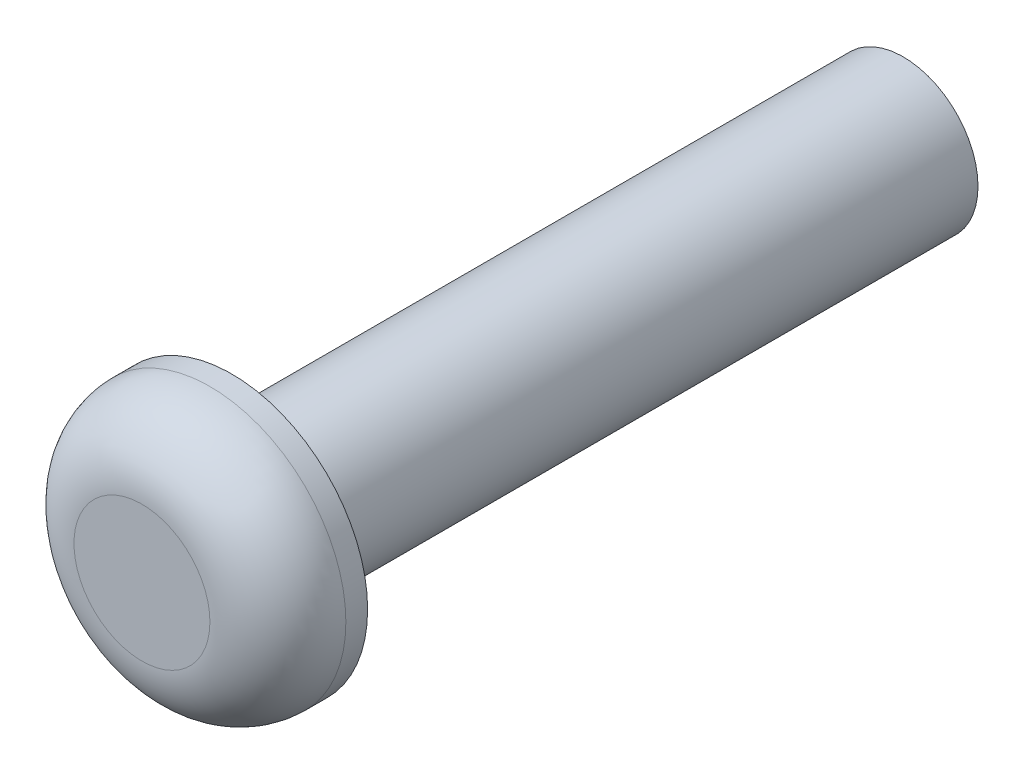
ISO-10303-21;
HEADER;
FILE_DESCRIPTION(('STEP AP214'),'2;1');
FILE_NAME('part.step','',(''),(''),'','','');
FILE_SCHEMA(('AUTOMOTIVE_DESIGN { 1 0 10303 214 1 1 1 1 }'));
ENDSEC;
DATA;
#1=APPLICATION_CONTEXT('core data for automotive mechanical design processes');
#2=APPLICATION_PROTOCOL_DEFINITION('international standard','automotive_design',2000,#1);
#3=PRODUCT_CONTEXT('',#1,'mechanical');
#4=PRODUCT('Part','Part','',(#3));
#5=PRODUCT_RELATED_PRODUCT_CATEGORY('part','',(#4));
#6=PRODUCT_DEFINITION_FORMATION('','',#4);
#7=PRODUCT_DEFINITION_CONTEXT('part definition',#1,'design');
#8=PRODUCT_DEFINITION('design','',#6,#7);
#9=PRODUCT_DEFINITION_SHAPE('','',#8);
#10=(LENGTH_UNIT() NAMED_UNIT(*) SI_UNIT(.MILLI.,.METRE.));
#11=(NAMED_UNIT(*) PLANE_ANGLE_UNIT() SI_UNIT($,.RADIAN.));
#12=(NAMED_UNIT(*) SI_UNIT($,.STERADIAN.) SOLID_ANGLE_UNIT());
#13=UNCERTAINTY_MEASURE_WITH_UNIT(LENGTH_MEASURE(1.E-05),#10,'distance_accuracy_value','');
#14=(GEOMETRIC_REPRESENTATION_CONTEXT(3) GLOBAL_UNCERTAINTY_ASSIGNED_CONTEXT((#13)) GLOBAL_UNIT_ASSIGNED_CONTEXT((#10,
#11,#12)) REPRESENTATION_CONTEXT('',''));
#15=CARTESIAN_POINT('',(0.,0.,0.));
#16=DIRECTION('',(0.,0.,1.));
#17=DIRECTION('',(1.,0.,0.));
#18=AXIS2_PLACEMENT_3D('',#15,#16,#17);
#19=CARTESIAN_POINT('',(0.,0.,1.6764));
#20=DIRECTION('',(0.,0.,-1.));
#21=DIRECTION('',(-1.,0.,0.));
#22=AXIS2_PLACEMENT_3D('',#19,#20,#21);
#23=CYLINDRICAL_SURFACE('',#22,2.54);
#24=CARTESIAN_POINT('',(0.,0.,0.4064));
#25=DIRECTION('',(0.,0.,1.));
#26=DIRECTION('',(1.,0.,0.));
#27=AXIS2_PLACEMENT_3D('',#24,#25,#26);
#28=CIRCLE('',#27,2.54);
#29=CARTESIAN_POINT('',(2.54,0.,0.4064));
#30=VERTEX_POINT('',#29);
#31=EDGE_CURVE('E10',#30,#30,#28,.F.);
#32=ORIENTED_EDGE('',*,*,#31,.T.);
#33=EDGE_LOOP('',(#32));
#34=FACE_BOUND('',#33,.T.);
#35=CARTESIAN_POINT('',(0.,0.,0.));
#36=DIRECTION('',(0.,0.,1.));
#37=DIRECTION('',(1.,0.,0.));
#38=AXIS2_PLACEMENT_3D('',#35,#36,#37);
#39=CIRCLE('',#38,2.54);
#40=CARTESIAN_POINT('',(2.54,0.,0.));
#41=VERTEX_POINT('',#40);
#42=EDGE_CURVE('E41',#41,#41,#39,.T.);
#43=ORIENTED_EDGE('',*,*,#42,.T.);
#44=EDGE_LOOP('',(#43));
#45=FACE_BOUND('',#44,.T.);
#46=ADVANCED_FACE('F30',(#34,#45),#23,.T.);
#47=CARTESIAN_POINT('',(0.,0.,1.6764));
#48=DIRECTION('',(0.,0.,1.));
#49=DIRECTION('',(1.,0.,0.));
#50=AXIS2_PLACEMENT_3D('',#47,#48,#49);
#51=PLANE('',#50);
#52=CARTESIAN_POINT('',(0.,0.,1.6764));
#53=DIRECTION('',(0.,0.,1.));
#54=DIRECTION('',(1.,0.,0.));
#55=AXIS2_PLACEMENT_3D('',#52,#53,#54);
#56=CIRCLE('',#55,1.27);
#57=CARTESIAN_POINT('',(1.27,0.,1.6764));
#58=VERTEX_POINT('',#57);
#59=EDGE_CURVE('E37',#58,#58,#56,.T.);
#60=ORIENTED_EDGE('',*,*,#59,.T.);
#61=EDGE_LOOP('',(#60));
#62=FACE_BOUND('',#61,.T.);
#63=ADVANCED_FACE('F68',(#62),#51,.T.);
#64=CARTESIAN_POINT('',(0.,0.,0.));
#65=DIRECTION('',(0.,0.,1.));
#66=DIRECTION('',(1.,0.,0.));
#67=AXIS2_PLACEMENT_3D('',#64,#65,#66);
#68=PLANE('',#67);
#69=CARTESIAN_POINT('',(0.,0.,0.));
#70=DIRECTION('',(0.,0.,1.));
#71=DIRECTION('',(1.,0.,0.));
#72=AXIS2_PLACEMENT_3D('',#69,#70,#71);
#73=CIRCLE('',#72,1.397);
#74=CARTESIAN_POINT('',(1.397,0.,0.));
#75=VERTEX_POINT('',#74);
#76=EDGE_CURVE('E45',#75,#75,#73,.T.);
#77=ORIENTED_EDGE('',*,*,#76,.T.);
#78=EDGE_LOOP('',(#77));
#79=FACE_BOUND('',#78,.T.);
#80=ORIENTED_EDGE('',*,*,#42,.F.);
#81=EDGE_LOOP('',(#80));
#82=FACE_BOUND('',#81,.T.);
#83=ADVANCED_FACE('F65',(#79,#82),#68,.F.);
#84=CARTESIAN_POINT('',(0.,0.,-12.5476));
#85=DIRECTION('',(0.,0.,1.));
#86=DIRECTION('',(1.,0.,0.));
#87=AXIS2_PLACEMENT_3D('',#84,#85,#86);
#88=CYLINDRICAL_SURFACE('',#87,1.397);
#89=CARTESIAN_POINT('',(0.,0.,-12.5476));
#90=DIRECTION('',(0.,0.,1.));
#91=DIRECTION('',(1.,0.,0.));
#92=AXIS2_PLACEMENT_3D('',#89,#90,#91);
#93=CIRCLE('',#92,1.397);
#94=CARTESIAN_POINT('',(1.397,0.,-12.5476));
#95=VERTEX_POINT('',#94);
#96=EDGE_CURVE('E49',#95,#95,#93,.T.);
#97=ORIENTED_EDGE('',*,*,#96,.T.);
#98=EDGE_LOOP('',(#97));
#99=FACE_BOUND('',#98,.T.);
#100=ORIENTED_EDGE('',*,*,#76,.F.);
#101=EDGE_LOOP('',(#100));
#102=FACE_BOUND('',#101,.T.);
#103=ADVANCED_FACE('F54',(#99,#102),#88,.T.);
#104=CARTESIAN_POINT('',(0.,0.,-12.5476));
#105=DIRECTION('',(0.,0.,1.));
#106=DIRECTION('',(1.,0.,0.));
#107=AXIS2_PLACEMENT_3D('',#104,#105,#106);
#108=PLANE('',#107);
#109=ORIENTED_EDGE('',*,*,#96,.F.);
#110=EDGE_LOOP('',(#109));
#111=FACE_BOUND('',#110,.T.);
#112=ADVANCED_FACE('F57',(#111),#108,.F.);
#113=CARTESIAN_POINT('',(0.,0.,0.4064));
#114=DIRECTION('',(0.,0.,1.));
#115=DIRECTION('',(1.,0.,0.));
#116=AXIS2_PLACEMENT_3D('',#113,#114,#115);
#117=DEGENERATE_TOROIDAL_SURFACE('',#116,1.27,1.27,.T.);
#118=ORIENTED_EDGE('',*,*,#31,.F.);
#119=EDGE_LOOP('',(#118));
#120=FACE_BOUND('',#119,.T.);
#121=ORIENTED_EDGE('',*,*,#59,.F.);
#122=EDGE_LOOP('',(#121));
#123=FACE_BOUND('',#122,.T.);
#124=ADVANCED_FACE('F32',(#120,#123),#117,.T.);
#125=CLOSED_SHELL('',(#46,#63,#83,#103,#112,#124));
#126=MANIFOLD_SOLID_BREP('B2',#125);
#127=ADVANCED_BREP_SHAPE_REPRESENTATION('',(#18,#126),#14);
#128=SHAPE_DEFINITION_REPRESENTATION(#9,#127);
ENDSEC;
END-ISO-10303-21;
